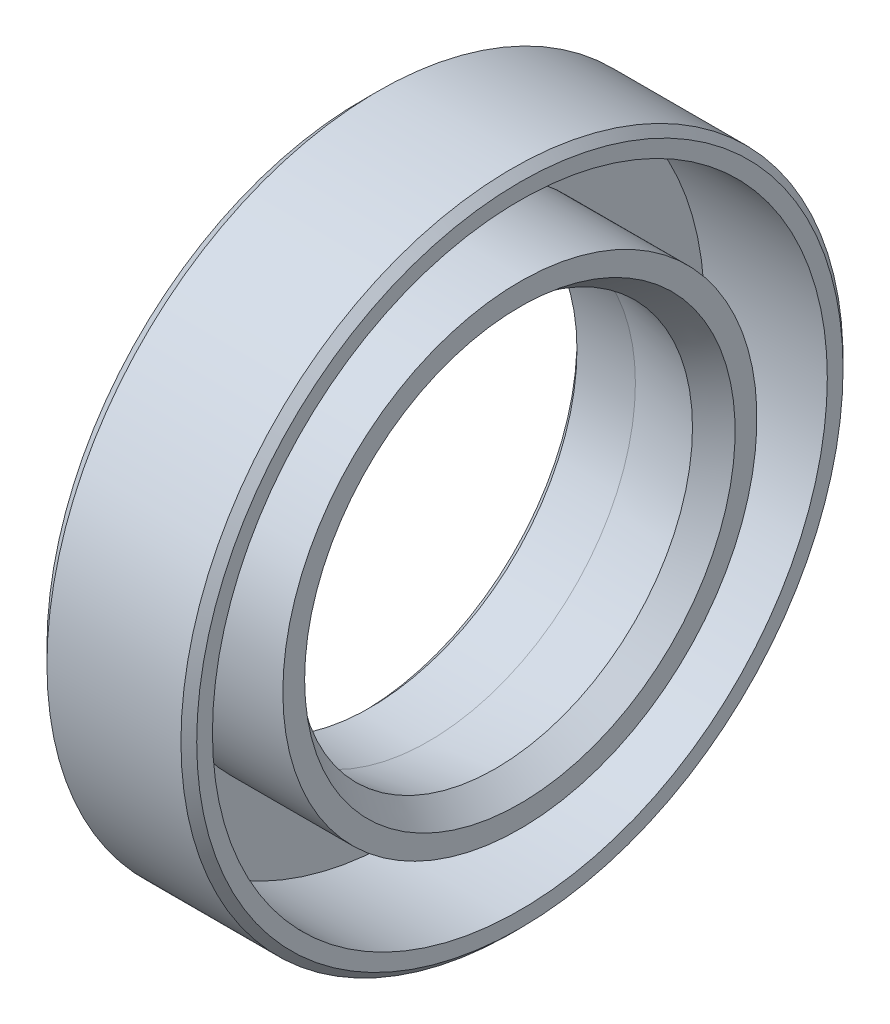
ISO-10303-21;
HEADER;
FILE_DESCRIPTION(('STEP AP214'),'2;1');
FILE_NAME('part.step','',(''),(''),'','','');
FILE_SCHEMA(('AUTOMOTIVE_DESIGN { 1 0 10303 214 1 1 1 1 }'));
ENDSEC;
DATA;
#1=APPLICATION_CONTEXT('core data for automotive mechanical design processes');
#2=APPLICATION_PROTOCOL_DEFINITION('international standard','automotive_design',2000,#1);
#3=PRODUCT_CONTEXT('',#1,'mechanical');
#4=PRODUCT('Part','Part','',(#3));
#5=PRODUCT_RELATED_PRODUCT_CATEGORY('part','',(#4));
#6=PRODUCT_DEFINITION_FORMATION('','',#4);
#7=PRODUCT_DEFINITION_CONTEXT('part definition',#1,'design');
#8=PRODUCT_DEFINITION('design','',#6,#7);
#9=PRODUCT_DEFINITION_SHAPE('','',#8);
#10=(LENGTH_UNIT() NAMED_UNIT(*) SI_UNIT(.MILLI.,.METRE.));
#11=(NAMED_UNIT(*) PLANE_ANGLE_UNIT() SI_UNIT($,.RADIAN.));
#12=(NAMED_UNIT(*) SI_UNIT($,.STERADIAN.) SOLID_ANGLE_UNIT());
#13=UNCERTAINTY_MEASURE_WITH_UNIT(LENGTH_MEASURE(1.E-05),#10,'distance_accuracy_value','');
#14=(GEOMETRIC_REPRESENTATION_CONTEXT(3) GLOBAL_UNCERTAINTY_ASSIGNED_CONTEXT((#13)) GLOBAL_UNIT_ASSIGNED_CONTEXT((#10,
#11,#12)) REPRESENTATION_CONTEXT('',''));
#15=CARTESIAN_POINT('',(0.,0.,0.));
#16=DIRECTION('',(0.,0.,1.));
#17=DIRECTION('',(1.,0.,0.));
#18=AXIS2_PLACEMENT_3D('',#15,#16,#17);
#19=CARTESIAN_POINT('',(-3.99999999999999,-16.75,0.));
#20=DIRECTION('',(1.,0.,0.));
#21=DIRECTION('',(0.,0.,-1.));
#22=AXIS2_PLACEMENT_3D('',#19,#20,#21);
#23=CONICAL_SURFACE('',#22,21.,0.785398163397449);
#24=CARTESIAN_POINT('',(-4.99999999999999,-16.75,0.));
#25=DIRECTION('',(-1.,0.,0.));
#26=DIRECTION('',(0.,0.,1.));
#27=AXIS2_PLACEMENT_3D('',#24,#25,#26);
#28=CIRCLE('',#27,20.);
#29=CARTESIAN_POINT('',(-4.99999999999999,-16.75,20.));
#30=VERTEX_POINT('',#29);
#31=EDGE_CURVE('E10',#30,#30,#28,.T.);
#32=ORIENTED_EDGE('',*,*,#31,.F.);
#33=EDGE_LOOP('',(#32));
#34=FACE_BOUND('',#33,.T.);
#35=CARTESIAN_POINT('',(-3.99999999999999,-16.75,0.));
#36=DIRECTION('',(-1.,0.,0.));
#37=DIRECTION('',(0.,0.,1.));
#38=AXIS2_PLACEMENT_3D('',#35,#36,#37);
#39=CIRCLE('',#38,21.);
#40=CARTESIAN_POINT('',(-3.99999999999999,-16.75,21.));
#41=VERTEX_POINT('',#40);
#42=EDGE_CURVE('E73',#41,#41,#39,.T.);
#43=ORIENTED_EDGE('',*,*,#42,.T.);
#44=EDGE_LOOP('',(#43));
#45=FACE_BOUND('',#44,.T.);
#46=ADVANCED_FACE('F30',(#34,#45),#23,.T.);
#47=CARTESIAN_POINT('',(-4.99999999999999,3.25000000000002,0.));
#48=DIRECTION('',(1.,0.,0.));
#49=DIRECTION('',(0.,0.,-1.));
#50=AXIS2_PLACEMENT_3D('',#47,#48,#49);
#51=PLANE('',#50);
#52=CARTESIAN_POINT('',(-4.99999999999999,-16.75,0.));
#53=DIRECTION('',(-1.,0.,0.));
#54=DIRECTION('',(0.,0.,1.));
#55=AXIS2_PLACEMENT_3D('',#52,#53,#54);
#56=CIRCLE('',#55,13.6217082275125);
#57=CARTESIAN_POINT('',(-4.99999999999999,-16.75,13.6217082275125));
#58=VERTEX_POINT('',#57);
#59=EDGE_CURVE('E36',#58,#58,#56,.T.);
#60=ORIENTED_EDGE('',*,*,#59,.F.);
#61=EDGE_LOOP('',(#60));
#62=FACE_BOUND('',#61,.T.);
#63=ORIENTED_EDGE('',*,*,#31,.T.);
#64=EDGE_LOOP('',(#63));
#65=FACE_BOUND('',#64,.T.);
#66=ADVANCED_FACE('F140',(#62,#65),#51,.F.);
#67=CARTESIAN_POINT('',(-4.99999999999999,-16.75,0.));
#68=DIRECTION('',(-1.,0.,0.));
#69=DIRECTION('',(0.,0.,1.));
#70=AXIS2_PLACEMENT_3D('',#67,#68,#69);
#71=CONICAL_SURFACE('',#70,13.6217082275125,0.78539816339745);
#72=CARTESIAN_POINT('',(-4.49999999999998,-16.75,0.));
#73=DIRECTION('',(-1.,0.,0.));
#74=DIRECTION('',(0.,0.,1.));
#75=AXIS2_PLACEMENT_3D('',#72,#73,#74);
#76=CIRCLE('',#75,13.1217082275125);
#77=CARTESIAN_POINT('',(-4.49999999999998,-16.75,13.1217082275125));
#78=VERTEX_POINT('',#77);
#79=EDGE_CURVE('E40',#78,#78,#76,.T.);
#80=ORIENTED_EDGE('',*,*,#79,.F.);
#81=EDGE_LOOP('',(#80));
#82=FACE_BOUND('',#81,.T.);
#83=ORIENTED_EDGE('',*,*,#59,.T.);
#84=EDGE_LOOP('',(#83));
#85=FACE_BOUND('',#84,.T.);
#86=ADVANCED_FACE('F135',(#82,#85),#71,.F.);
#87=CARTESIAN_POINT('',(3.44867579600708,-16.75,0.));
#88=DIRECTION('',(-1.,0.,0.));
#89=DIRECTION('',(0.,0.,1.));
#90=AXIS2_PLACEMENT_3D('',#87,#88,#89);
#91=CYLINDRICAL_SURFACE('',#90,13.1217082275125);
#92=CARTESIAN_POINT('',(-0.794073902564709,-16.75,0.));
#93=DIRECTION('',(-1.,0.,0.));
#94=DIRECTION('',(0.,0.,1.));
#95=AXIS2_PLACEMENT_3D('',#92,#93,#94);
#96=CIRCLE('',#95,13.1217082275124);
#97=CARTESIAN_POINT('',(-0.794073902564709,-16.75,13.1217082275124));
#98=VERTEX_POINT('',#97);
#99=EDGE_CURVE('E44',#98,#98,#96,.T.);
#100=ORIENTED_EDGE('',*,*,#99,.F.);
#101=EDGE_LOOP('',(#100));
#102=FACE_BOUND('',#101,.T.);
#103=ORIENTED_EDGE('',*,*,#79,.T.);
#104=EDGE_LOOP('',(#103));
#105=FACE_BOUND('',#104,.T.);
#106=ADVANCED_FACE('F129',(#102,#105),#91,.F.);
#107=CARTESIAN_POINT('',(-0.794073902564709,-16.75,0.));
#108=DIRECTION('',(-1.,0.,0.));
#109=DIRECTION('',(0.,0.,1.));
#110=AXIS2_PLACEMENT_3D('',#107,#108,#109);
#111=CONICAL_SURFACE('',#110,13.1217082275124,0.145498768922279);
#112=CARTESIAN_POINT('',(3.44867579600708,-16.75,0.));
#113=DIRECTION('',(-1.,0.,0.));
#114=DIRECTION('',(0.,0.,1.));
#115=AXIS2_PLACEMENT_3D('',#112,#113,#114);
#116=CIRCLE('',#115,12.5);
#117=CARTESIAN_POINT('',(3.44867579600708,-16.75,12.5));
#118=VERTEX_POINT('',#117);
#119=EDGE_CURVE('E49',#118,#118,#116,.T.);
#120=ORIENTED_EDGE('',*,*,#119,.F.);
#121=EDGE_LOOP('',(#120));
#122=FACE_BOUND('',#121,.T.);
#123=ORIENTED_EDGE('',*,*,#99,.T.);
#124=EDGE_LOOP('',(#123));
#125=FACE_BOUND('',#124,.T.);
#126=ADVANCED_FACE('F123',(#122,#125),#111,.F.);
#127=CARTESIAN_POINT('',(3.44867579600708,-16.75,0.));
#128=DIRECTION('',(1.,0.,0.));
#129=DIRECTION('',(0.,0.,-1.));
#130=AXIS2_PLACEMENT_3D('',#127,#128,#129);
#131=CONICAL_SURFACE('',#130,12.5,0.639899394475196);
#132=CARTESIAN_POINT('',(5.00000000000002,-16.75,0.));
#133=DIRECTION('',(-1.,0.,0.));
#134=DIRECTION('',(0.,0.,1.));
#135=AXIS2_PLACEMENT_3D('',#132,#133,#134);
#136=CIRCLE('',#135,13.6547862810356);
#137=CARTESIAN_POINT('',(5.00000000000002,-16.75,13.6547862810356));
#138=VERTEX_POINT('',#137);
#139=EDGE_CURVE('E52',#138,#138,#136,.T.);
#140=ORIENTED_EDGE('',*,*,#139,.F.);
#141=EDGE_LOOP('',(#140));
#142=FACE_BOUND('',#141,.T.);
#143=ORIENTED_EDGE('',*,*,#119,.T.);
#144=EDGE_LOOP('',(#143));
#145=FACE_BOUND('',#144,.T.);
#146=ADVANCED_FACE('F117',(#142,#145),#131,.F.);
#147=CARTESIAN_POINT('',(5.00000000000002,-1.71426935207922,0.));
#148=DIRECTION('',(-1.,0.,0.));
#149=DIRECTION('',(0.,0.,1.));
#150=AXIS2_PLACEMENT_3D('',#147,#148,#149);
#151=PLANE('',#150);
#152=CARTESIAN_POINT('',(5.00000000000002,-16.75,0.));
#153=DIRECTION('',(-1.,0.,0.));
#154=DIRECTION('',(0.,0.,1.));
#155=AXIS2_PLACEMENT_3D('',#152,#153,#154);
#156=CIRCLE('',#155,15.0357306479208);
#157=CARTESIAN_POINT('',(5.00000000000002,-16.75,15.0357306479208));
#158=VERTEX_POINT('',#157);
#159=EDGE_CURVE('E55',#158,#158,#156,.T.);
#160=ORIENTED_EDGE('',*,*,#159,.F.);
#161=EDGE_LOOP('',(#160));
#162=FACE_BOUND('',#161,.T.);
#163=ORIENTED_EDGE('',*,*,#139,.T.);
#164=EDGE_LOOP('',(#163));
#165=FACE_BOUND('',#164,.T.);
#166=ADVANCED_FACE('F111',(#162,#165),#151,.F.);
#167=CARTESIAN_POINT('',(3.44867579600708,-16.75,0.));
#168=DIRECTION('',(-1.,0.,0.));
#169=DIRECTION('',(0.,0.,1.));
#170=AXIS2_PLACEMENT_3D('',#167,#168,#169);
#171=CYLINDRICAL_SURFACE('',#170,15.0357306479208);
#172=CARTESIAN_POINT('',(-2.80379744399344,-16.75,0.));
#173=DIRECTION('',(-1.,0.,0.));
#174=DIRECTION('',(0.,0.,1.));
#175=AXIS2_PLACEMENT_3D('',#172,#173,#174);
#176=CIRCLE('',#175,15.0357306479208);
#177=CARTESIAN_POINT('',(-2.80379744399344,-16.75,15.0357306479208));
#178=VERTEX_POINT('',#177);
#179=EDGE_CURVE('E58',#178,#178,#176,.T.);
#180=ORIENTED_EDGE('',*,*,#179,.F.);
#181=EDGE_LOOP('',(#180));
#182=FACE_BOUND('',#181,.T.);
#183=ORIENTED_EDGE('',*,*,#159,.T.);
#184=EDGE_LOOP('',(#183));
#185=FACE_BOUND('',#184,.T.);
#186=ADVANCED_FACE('F105',(#182,#185),#171,.T.);
#187=CARTESIAN_POINT('',(-2.80379744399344,2.75178296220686,0.));
#188=DIRECTION('',(-1.,0.,0.));
#189=DIRECTION('',(0.,0.,1.));
#190=AXIS2_PLACEMENT_3D('',#187,#188,#189);
#191=PLANE('',#190);
#192=CARTESIAN_POINT('',(-2.80379744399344,-16.75,0.));
#193=DIRECTION('',(-1.,0.,0.));
#194=DIRECTION('',(0.,0.,1.));
#195=AXIS2_PLACEMENT_3D('',#192,#193,#194);
#196=CIRCLE('',#195,19.5017829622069);
#197=CARTESIAN_POINT('',(-2.80379744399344,-16.75,19.5017829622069));
#198=VERTEX_POINT('',#197);
#199=EDGE_CURVE('E61',#198,#198,#196,.T.);
#200=ORIENTED_EDGE('',*,*,#199,.F.);
#201=EDGE_LOOP('',(#200));
#202=FACE_BOUND('',#201,.T.);
#203=ORIENTED_EDGE('',*,*,#179,.T.);
#204=EDGE_LOOP('',(#203));
#205=FACE_BOUND('',#204,.T.);
#206=ADVANCED_FACE('F99',(#202,#205),#191,.F.);
#207=CARTESIAN_POINT('',(3.44867579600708,-16.75,0.));
#208=DIRECTION('',(-1.,0.,0.));
#209=DIRECTION('',(0.,0.,1.));
#210=AXIS2_PLACEMENT_3D('',#207,#208,#209);
#211=CYLINDRICAL_SURFACE('',#210,19.5017829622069);
#212=CARTESIAN_POINT('',(5.00000000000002,-16.75,0.));
#213=DIRECTION('',(-1.,0.,0.));
#214=DIRECTION('',(0.,0.,1.));
#215=AXIS2_PLACEMENT_3D('',#212,#213,#214);
#216=CIRCLE('',#215,19.5017829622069);
#217=CARTESIAN_POINT('',(5.00000000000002,-16.75,19.5017829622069));
#218=VERTEX_POINT('',#217);
#219=EDGE_CURVE('E64',#218,#218,#216,.T.);
#220=ORIENTED_EDGE('',*,*,#219,.F.);
#221=EDGE_LOOP('',(#220));
#222=FACE_BOUND('',#221,.T.);
#223=ORIENTED_EDGE('',*,*,#199,.T.);
#224=EDGE_LOOP('',(#223));
#225=FACE_BOUND('',#224,.T.);
#226=ADVANCED_FACE('F93',(#222,#225),#211,.F.);
#227=CARTESIAN_POINT('',(5.00000000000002,3.75000000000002,0.));
#228=DIRECTION('',(-1.,0.,0.));
#229=DIRECTION('',(0.,0.,1.));
#230=AXIS2_PLACEMENT_3D('',#227,#228,#229);
#231=PLANE('',#230);
#232=CARTESIAN_POINT('',(5.00000000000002,-16.75,0.));
#233=DIRECTION('',(-1.,0.,0.));
#234=DIRECTION('',(0.,0.,1.));
#235=AXIS2_PLACEMENT_3D('',#232,#233,#234);
#236=CIRCLE('',#235,20.5);
#237=CARTESIAN_POINT('',(5.00000000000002,-16.75,20.5));
#238=VERTEX_POINT('',#237);
#239=EDGE_CURVE('E67',#238,#238,#236,.T.);
#240=ORIENTED_EDGE('',*,*,#239,.F.);
#241=EDGE_LOOP('',(#240));
#242=FACE_BOUND('',#241,.T.);
#243=ORIENTED_EDGE('',*,*,#219,.T.);
#244=EDGE_LOOP('',(#243));
#245=FACE_BOUND('',#244,.T.);
#246=ADVANCED_FACE('F87',(#242,#245),#231,.F.);
#247=CARTESIAN_POINT('',(5.00000000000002,-16.75,0.));
#248=DIRECTION('',(-1.,0.,0.));
#249=DIRECTION('',(0.,0.,1.));
#250=AXIS2_PLACEMENT_3D('',#247,#248,#249);
#251=CONICAL_SURFACE('',#250,20.5,0.785398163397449);
#252=CARTESIAN_POINT('',(4.50000000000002,-16.75,0.));
#253=DIRECTION('',(-1.,0.,0.));
#254=DIRECTION('',(0.,0.,1.));
#255=AXIS2_PLACEMENT_3D('',#252,#253,#254);
#256=CIRCLE('',#255,21.);
#257=CARTESIAN_POINT('',(4.50000000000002,-16.75,21.));
#258=VERTEX_POINT('',#257);
#259=EDGE_CURVE('E70',#258,#258,#256,.T.);
#260=ORIENTED_EDGE('',*,*,#259,.F.);
#261=EDGE_LOOP('',(#260));
#262=FACE_BOUND('',#261,.T.);
#263=ORIENTED_EDGE('',*,*,#239,.T.);
#264=EDGE_LOOP('',(#263));
#265=FACE_BOUND('',#264,.T.);
#266=ADVANCED_FACE('F81',(#262,#265),#251,.T.);
#267=CARTESIAN_POINT('',(3.44867579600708,-16.75,0.));
#268=DIRECTION('',(-1.,0.,0.));
#269=DIRECTION('',(0.,0.,1.));
#270=AXIS2_PLACEMENT_3D('',#267,#268,#269);
#271=CYLINDRICAL_SURFACE('',#270,21.);
#272=ORIENTED_EDGE('',*,*,#42,.F.);
#273=EDGE_LOOP('',(#272));
#274=FACE_BOUND('',#273,.T.);
#275=ORIENTED_EDGE('',*,*,#259,.T.);
#276=EDGE_LOOP('',(#275));
#277=FACE_BOUND('',#276,.T.);
#278=ADVANCED_FACE('F78',(#274,#277),#271,.T.);
#279=CLOSED_SHELL('',(#46,#66,#86,#106,#126,#146,#166,#186,#206,#226,#246,#266,#278));
#280=MANIFOLD_SOLID_BREP('B2',#279);
#281=ADVANCED_BREP_SHAPE_REPRESENTATION('',(#18,#280),#14);
#282=SHAPE_DEFINITION_REPRESENTATION(#9,#281);
ENDSEC;
END-ISO-10303-21;
